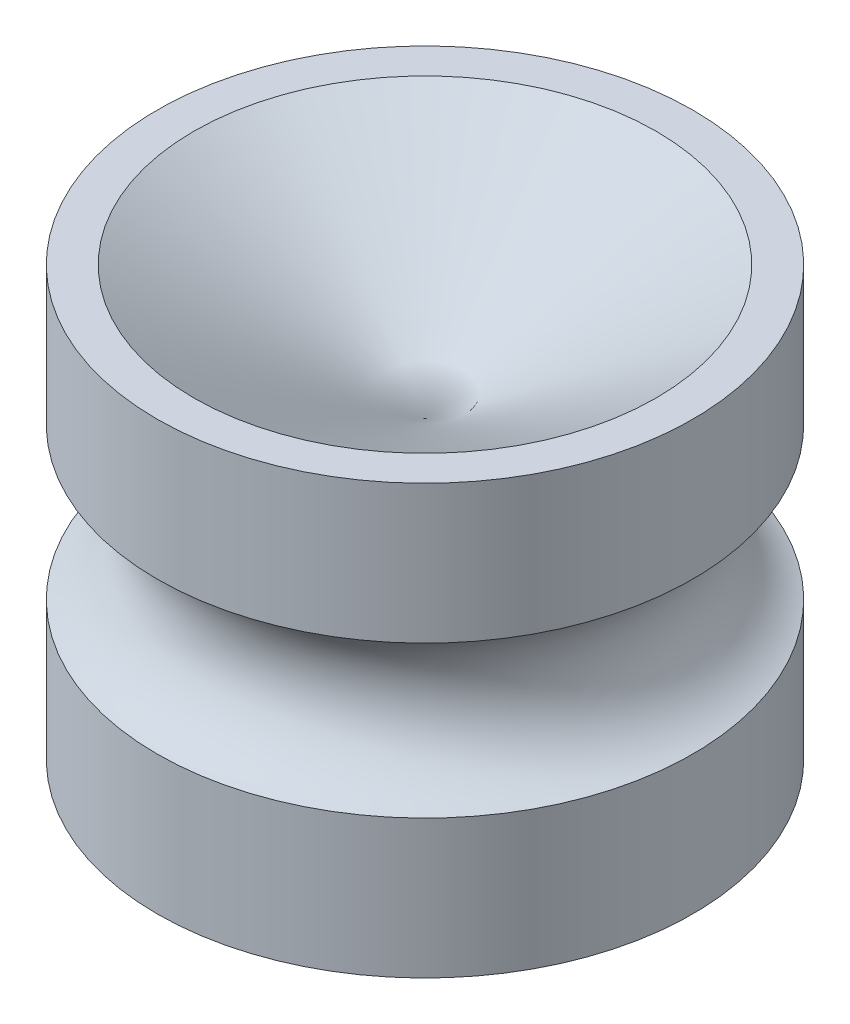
ISO-10303-21;
HEADER;
FILE_DESCRIPTION(('STEP AP214'),'2;1');
FILE_NAME('part.step','',(''),(''),'','','');
FILE_SCHEMA(('AUTOMOTIVE_DESIGN { 1 0 10303 214 1 1 1 1 }'));
ENDSEC;
DATA;
#1=APPLICATION_CONTEXT('core data for automotive mechanical design processes');
#2=APPLICATION_PROTOCOL_DEFINITION('international standard','automotive_design',2000,#1);
#3=PRODUCT_CONTEXT('',#1,'mechanical');
#4=PRODUCT('Part','Part','',(#3));
#5=PRODUCT_RELATED_PRODUCT_CATEGORY('part','',(#4));
#6=PRODUCT_DEFINITION_FORMATION('','',#4);
#7=PRODUCT_DEFINITION_CONTEXT('part definition',#1,'design');
#8=PRODUCT_DEFINITION('design','',#6,#7);
#9=PRODUCT_DEFINITION_SHAPE('','',#8);
#10=(LENGTH_UNIT() NAMED_UNIT(*) SI_UNIT(.MILLI.,.METRE.));
#11=(NAMED_UNIT(*) PLANE_ANGLE_UNIT() SI_UNIT($,.RADIAN.));
#12=(NAMED_UNIT(*) SI_UNIT($,.STERADIAN.) SOLID_ANGLE_UNIT());
#13=UNCERTAINTY_MEASURE_WITH_UNIT(LENGTH_MEASURE(1.E-05),#10,'distance_accuracy_value','');
#14=(GEOMETRIC_REPRESENTATION_CONTEXT(3) GLOBAL_UNCERTAINTY_ASSIGNED_CONTEXT((#13)) GLOBAL_UNIT_ASSIGNED_CONTEXT((#10,
#11,#12)) REPRESENTATION_CONTEXT('',''));
#15=CARTESIAN_POINT('',(0.,0.,0.));
#16=DIRECTION('',(0.,0.,1.));
#17=DIRECTION('',(1.,0.,0.));
#18=AXIS2_PLACEMENT_3D('',#15,#16,#17);
#19=CARTESIAN_POINT('',(0.,50.,0.));
#20=DIRECTION('',(0.,1.,0.));
#21=DIRECTION('',(0.,0.,1.));
#22=AXIS2_PLACEMENT_3D('',#19,#20,#21);
#23=CYLINDRICAL_SURFACE('',#22,2.5);
#24=CARTESIAN_POINT('',(0.,0.707106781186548,0.));
#25=DIRECTION('',(0.,-1.,0.));
#26=DIRECTION('',(0.,0.,-1.));
#27=AXIS2_PLACEMENT_3D('',#24,#25,#26);
#28=CIRCLE('',#27,2.5);
#29=CARTESIAN_POINT('',(0.,0.707106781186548,-2.5));
#30=VERTEX_POINT('',#29);
#31=EDGE_CURVE('E41',#30,#30,#28,.T.);
#32=ORIENTED_EDGE('',*,*,#31,.F.);
#33=EDGE_LOOP('',(#32));
#34=FACE_BOUND('',#33,.T.);
#35=CARTESIAN_POINT('',(0.,2.,0.));
#36=DIRECTION('',(0.,1.,0.));
#37=DIRECTION('',(0.,0.,1.));
#38=AXIS2_PLACEMENT_3D('',#35,#36,#37);
#39=CIRCLE('',#38,2.5);
#40=CARTESIAN_POINT('',(0.,2.,2.5));
#41=VERTEX_POINT('',#40);
#42=EDGE_CURVE('E11',#41,#41,#39,.T.);
#43=ORIENTED_EDGE('',*,*,#42,.F.);
#44=EDGE_LOOP('',(#43));
#45=FACE_BOUND('',#44,.T.);
#46=ADVANCED_FACE('F37',(#34,#45),#23,.T.);
#47=CARTESIAN_POINT('',(0.,2.,0.));
#48=DIRECTION('',(0.,1.,0.));
#49=DIRECTION('',(0.,0.,1.));
#50=AXIS2_PLACEMENT_3D('',#47,#48,#49);
#51=PLANE('',#50);
#52=CARTESIAN_POINT('',(0.,2.,0.));
#53=DIRECTION('',(0.,1.,0.));
#54=DIRECTION('',(0.,0.,1.));
#55=AXIS2_PLACEMENT_3D('',#52,#53,#54);
#56=CIRCLE('',#55,2.15742015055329);
#57=CARTESIAN_POINT('',(0.,2.,2.15742015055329));
#58=VERTEX_POINT('',#57);
#59=EDGE_CURVE('E57',#58,#58,#56,.T.);
#60=ORIENTED_EDGE('',*,*,#59,.F.);
#61=EDGE_LOOP('',(#60));
#62=FACE_BOUND('',#61,.T.);
#63=ORIENTED_EDGE('',*,*,#42,.T.);
#64=EDGE_LOOP('',(#63));
#65=FACE_BOUND('',#64,.T.);
#66=ADVANCED_FACE('F39',(#62,#65),#51,.T.);
#67=CARTESIAN_POINT('',(0.,0.,0.));
#68=DIRECTION('',(0.,1.,0.));
#69=DIRECTION('',(0.,0.,1.));
#70=AXIS2_PLACEMENT_3D('',#67,#68,#69);
#71=TOROIDAL_SURFACE('',#70,2.75,0.75);
#72=ORIENTED_EDGE('',*,*,#31,.T.);
#73=EDGE_LOOP('',(#72));
#74=FACE_BOUND('',#73,.T.);
#75=CARTESIAN_POINT('',(0.,-0.707106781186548,0.));
#76=DIRECTION('',(0.,1.,0.));
#77=DIRECTION('',(0.,0.,1.));
#78=AXIS2_PLACEMENT_3D('',#75,#76,#77);
#79=CIRCLE('',#78,2.5);
#80=CARTESIAN_POINT('',(0.,-0.707106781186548,2.5));
#81=VERTEX_POINT('',#80);
#82=EDGE_CURVE('E60',#81,#81,#79,.T.);
#83=ORIENTED_EDGE('',*,*,#82,.T.);
#84=EDGE_LOOP('',(#83));
#85=FACE_BOUND('',#84,.T.);
#86=ADVANCED_FACE('F76',(#74,#85),#71,.F.);
#87=CARTESIAN_POINT('',(-2.5,-2.,0.));
#88=DIRECTION('',(0.,-1.,0.));
#89=DIRECTION('',(0.,0.,-1.));
#90=AXIS2_PLACEMENT_3D('',#87,#88,#89);
#91=PLANE('',#90);
#92=CARTESIAN_POINT('',(0.,-2.,0.));
#93=DIRECTION('',(0.,1.,0.));
#94=DIRECTION('',(0.,0.,1.));
#95=AXIS2_PLACEMENT_3D('',#92,#93,#94);
#96=CIRCLE('',#95,2.5);
#97=CARTESIAN_POINT('',(0.,-2.,2.5));
#98=VERTEX_POINT('',#97);
#99=EDGE_CURVE('E46',#98,#98,#96,.T.);
#100=ORIENTED_EDGE('',*,*,#99,.F.);
#101=EDGE_LOOP('',(#100));
#102=FACE_BOUND('',#101,.T.);
#103=ADVANCED_FACE('F87',(#102),#91,.T.);
#104=ORIENTED_EDGE('',*,*,#82,.F.);
#105=EDGE_LOOP('',(#104));
#106=FACE_BOUND('',#105,.T.);
#107=ORIENTED_EDGE('',*,*,#99,.T.);
#108=EDGE_LOOP('',(#107));
#109=FACE_BOUND('',#108,.T.);
#110=ADVANCED_FACE('F53',(#106,#109),#23,.T.);
#111=CARTESIAN_POINT('',(0.,2.,0.));
#112=DIRECTION('',(0.,1.,0.));
#113=DIRECTION('',(0.,0.,1.));
#114=AXIS2_PLACEMENT_3D('',#111,#112,#113);
#115=CONICAL_SURFACE('',#114,2.15742015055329,1.0471975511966);
#116=CARTESIAN_POINT('',(0.,0.754412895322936,0.));
#117=VERTEX_POINT('',#116);
#118=VERTEX_LOOP('',#117);
#119=FACE_BOUND('',#118,.T.);
#120=ORIENTED_EDGE('',*,*,#59,.T.);
#121=EDGE_LOOP('',(#120));
#122=FACE_BOUND('',#121,.T.);
#123=ADVANCED_FACE('F50',(#119,#122),#115,.F.);
#124=CLOSED_SHELL('',(#46,#66,#86,#103,#110,#123));
#125=MANIFOLD_SOLID_BREP('B2',#124);
#126=ADVANCED_BREP_SHAPE_REPRESENTATION('',(#18,#125),#14);
#127=SHAPE_DEFINITION_REPRESENTATION(#9,#126);
ENDSEC;
END-ISO-10303-21;
